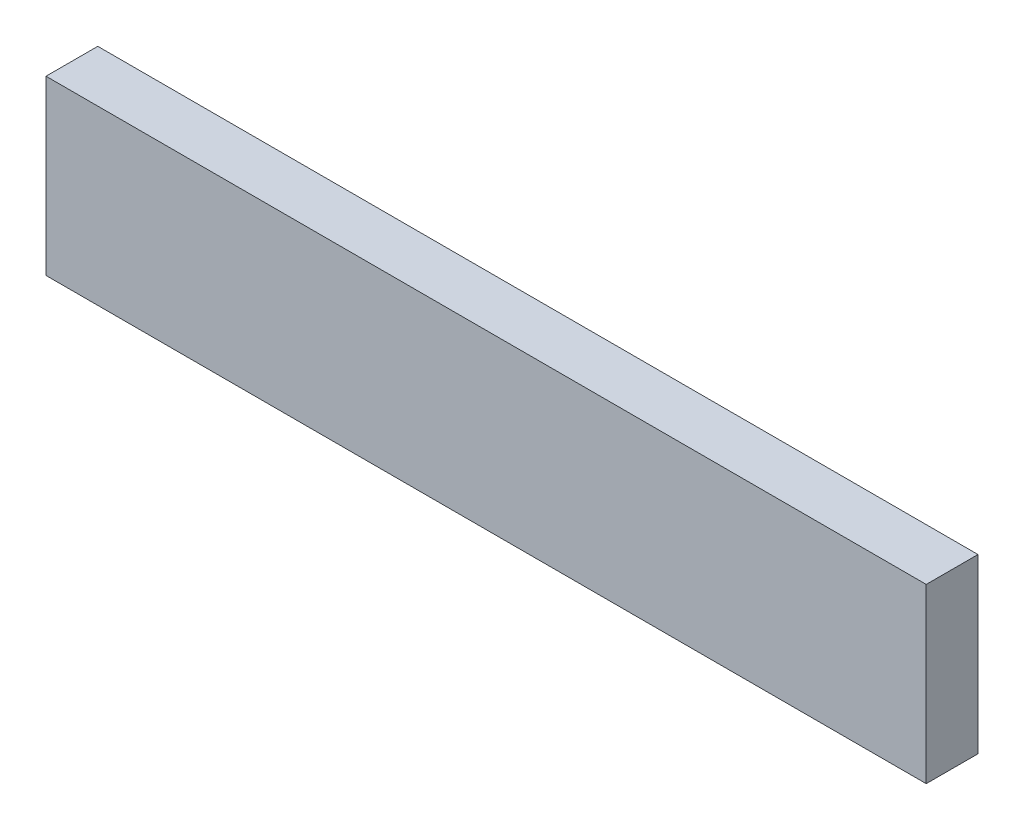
from build123d import *

# Parameters (mm, degrees)
SKETCH1_W           = 25.908
SKETCH1_H           = 5.08
BOSS_EXTRUDE1_DEPTH = 1.524


with BuildPart() as part:
    # Sketch1 → Boss-Extrude1 (new body)
    with BuildSketch(Plane.XY):
        with Locations((-12.954, 25.14119341)):
            Rectangle(SKETCH1_W, SKETCH1_H)
    extrude(amount=BOSS_EXTRUDE1_DEPTH)


solid = part.part
